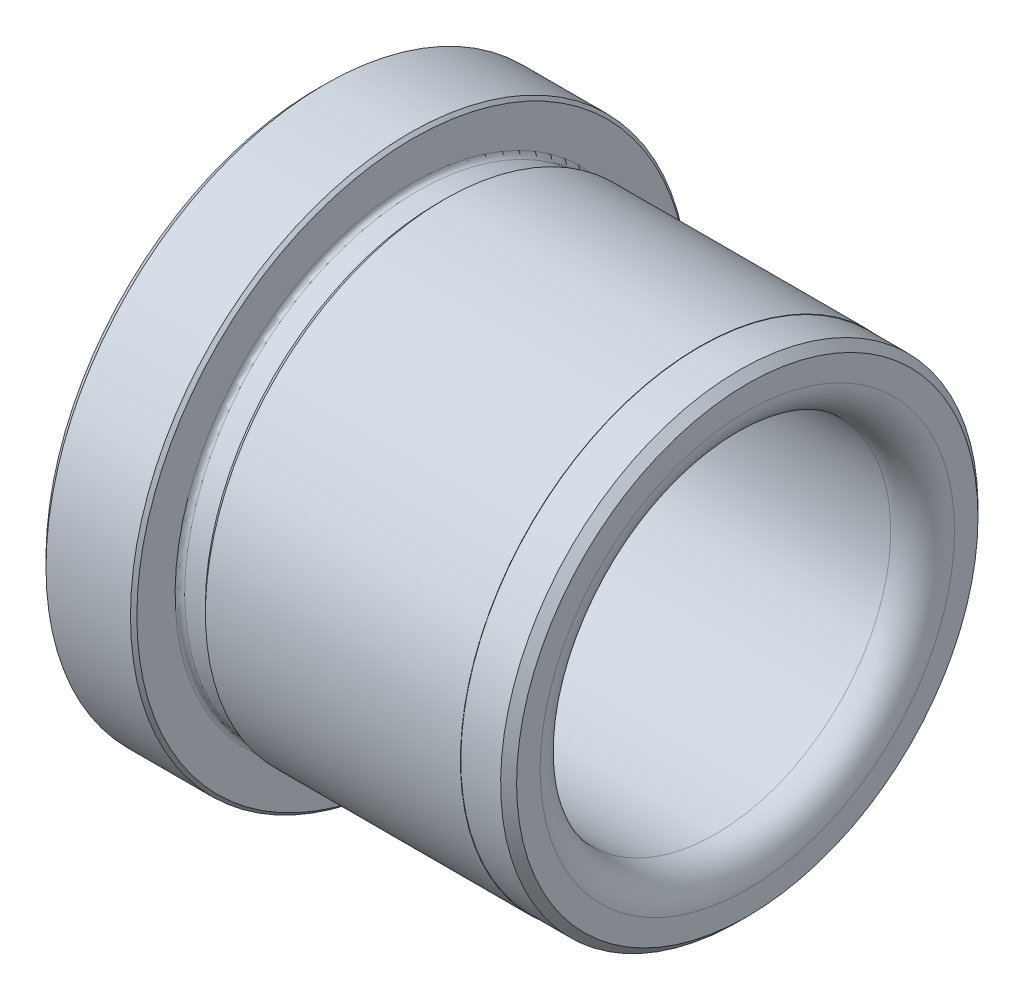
ISO-10303-21;
HEADER;
FILE_DESCRIPTION(('STEP AP214'),'2;1');
FILE_NAME('part.step','',(''),(''),'','','');
FILE_SCHEMA(('AUTOMOTIVE_DESIGN { 1 0 10303 214 1 1 1 1 }'));
ENDSEC;
DATA;
#1=APPLICATION_CONTEXT('core data for automotive mechanical design processes');
#2=APPLICATION_PROTOCOL_DEFINITION('international standard','automotive_design',2000,#1);
#3=PRODUCT_CONTEXT('',#1,'mechanical');
#4=PRODUCT('Part','Part','',(#3));
#5=PRODUCT_RELATED_PRODUCT_CATEGORY('part','',(#4));
#6=PRODUCT_DEFINITION_FORMATION('','',#4);
#7=PRODUCT_DEFINITION_CONTEXT('part definition',#1,'design');
#8=PRODUCT_DEFINITION('design','',#6,#7);
#9=PRODUCT_DEFINITION_SHAPE('','',#8);
#10=(LENGTH_UNIT() NAMED_UNIT(*) SI_UNIT(.MILLI.,.METRE.));
#11=(NAMED_UNIT(*) PLANE_ANGLE_UNIT() SI_UNIT($,.RADIAN.));
#12=(NAMED_UNIT(*) SI_UNIT($,.STERADIAN.) SOLID_ANGLE_UNIT());
#13=UNCERTAINTY_MEASURE_WITH_UNIT(LENGTH_MEASURE(1.E-05),#10,'distance_accuracy_value','');
#14=(GEOMETRIC_REPRESENTATION_CONTEXT(3) GLOBAL_UNCERTAINTY_ASSIGNED_CONTEXT((#13)) GLOBAL_UNIT_ASSIGNED_CONTEXT((#10,
#11,#12)) REPRESENTATION_CONTEXT('',''));
#15=CARTESIAN_POINT('',(0.,0.,0.));
#16=DIRECTION('',(0.,0.,1.));
#17=DIRECTION('',(1.,0.,0.));
#18=AXIS2_PLACEMENT_3D('',#15,#16,#17);
#19=CARTESIAN_POINT('',(-7.2,0.,0.));
#20=DIRECTION('',(1.,0.,0.));
#21=DIRECTION('',(0.,1.,0.));
#22=AXIS2_PLACEMENT_3D('',#19,#20,#21);
#23=TOROIDAL_SURFACE('',#22,14.9,0.300000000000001);
#24=CARTESIAN_POINT('',(-7.5,0.,0.));
#25=DIRECTION('',(1.,0.,0.));
#26=DIRECTION('',(0.,1.,0.));
#27=AXIS2_PLACEMENT_3D('',#24,#25,#26);
#28=CIRCLE('',#27,14.9);
#29=CARTESIAN_POINT('',(-7.50000000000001,14.9,0.));
#30=VERTEX_POINT('',#29);
#31=EDGE_CURVE('E83',#30,#30,#28,.T.);
#32=ORIENTED_EDGE('',*,*,#31,.T.);
#33=EDGE_LOOP('',(#32));
#34=FACE_BOUND('',#33,.T.);
#35=CARTESIAN_POINT('',(-7.2,0.,0.));
#36=DIRECTION('',(1.,0.,0.));
#37=DIRECTION('',(0.,1.,0.));
#38=AXIS2_PLACEMENT_3D('',#35,#36,#37);
#39=CIRCLE('',#38,14.6);
#40=CARTESIAN_POINT('',(-7.20000000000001,14.6,0.));
#41=VERTEX_POINT('',#40);
#42=EDGE_CURVE('E68',#41,#41,#39,.T.);
#43=ORIENTED_EDGE('',*,*,#42,.F.);
#44=EDGE_LOOP('',(#43));
#45=FACE_BOUND('',#44,.T.);
#46=ADVANCED_FACE('F30',(#34,#45),#23,.F.);
#47=CARTESIAN_POINT('',(13.5,0.,0.));
#48=DIRECTION('',(1.,0.,0.));
#49=DIRECTION('',(0.,1.,0.));
#50=AXIS2_PLACEMENT_3D('',#47,#48,#49);
#51=CYLINDRICAL_SURFACE('',#50,14.6);
#52=ORIENTED_EDGE('',*,*,#42,.T.);
#53=EDGE_LOOP('',(#52));
#54=FACE_BOUND('',#53,.T.);
#55=CARTESIAN_POINT('',(-5.9,0.,0.));
#56=DIRECTION('',(1.,0.,0.));
#57=DIRECTION('',(0.,1.,0.));
#58=AXIS2_PLACEMENT_3D('',#55,#56,#57);
#59=CIRCLE('',#58,14.6);
#60=CARTESIAN_POINT('',(-5.9,14.6,0.));
#61=VERTEX_POINT('',#60);
#62=EDGE_CURVE('E71',#61,#61,#59,.T.);
#63=ORIENTED_EDGE('',*,*,#62,.F.);
#64=EDGE_LOOP('',(#63));
#65=FACE_BOUND('',#64,.T.);
#66=ADVANCED_FACE('F104',(#54,#65),#51,.T.);
#67=CARTESIAN_POINT('',(-5.5,0.,0.));
#68=DIRECTION('',(1.,0.,0.));
#69=DIRECTION('',(0.,1.,0.));
#70=AXIS2_PLACEMENT_3D('',#67,#68,#69);
#71=CONICAL_SURFACE('',#70,15.,0.78539816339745);
#72=ORIENTED_EDGE('',*,*,#62,.T.);
#73=EDGE_LOOP('',(#72));
#74=FACE_BOUND('',#73,.T.);
#75=CARTESIAN_POINT('',(-5.5,0.,0.));
#76=DIRECTION('',(1.,0.,0.));
#77=DIRECTION('',(0.,1.,0.));
#78=AXIS2_PLACEMENT_3D('',#75,#76,#77);
#79=CIRCLE('',#78,15.);
#80=CARTESIAN_POINT('',(-5.50000000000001,15.,0.));
#81=VERTEX_POINT('',#80);
#82=EDGE_CURVE('E74',#81,#81,#79,.T.);
#83=ORIENTED_EDGE('',*,*,#82,.F.);
#84=EDGE_LOOP('',(#83));
#85=FACE_BOUND('',#84,.T.);
#86=ADVANCED_FACE('F109',(#74,#85),#71,.T.);
#87=CARTESIAN_POINT('',(13.5,0.,0.));
#88=DIRECTION('',(1.,0.,0.));
#89=DIRECTION('',(0.,1.,0.));
#90=AXIS2_PLACEMENT_3D('',#87,#88,#89);
#91=CYLINDRICAL_SURFACE('',#90,15.);
#92=ORIENTED_EDGE('',*,*,#82,.T.);
#93=EDGE_LOOP('',(#92));
#94=FACE_BOUND('',#93,.T.);
#95=CARTESIAN_POINT('',(10.5,0.,0.));
#96=DIRECTION('',(1.,0.,0.));
#97=DIRECTION('',(0.,1.,0.));
#98=AXIS2_PLACEMENT_3D('',#95,#96,#97);
#99=CIRCLE('',#98,15.);
#100=CARTESIAN_POINT('',(10.5,15.,0.));
#101=VERTEX_POINT('',#100);
#102=EDGE_CURVE('E77',#101,#101,#99,.T.);
#103=ORIENTED_EDGE('',*,*,#102,.F.);
#104=EDGE_LOOP('',(#103));
#105=FACE_BOUND('',#104,.T.);
#106=ADVANCED_FACE('F156',(#94,#105),#91,.T.);
#107=CARTESIAN_POINT('',(10.5,14.975,0.));
#108=DIRECTION('',(1.,0.,0.));
#109=DIRECTION('',(0.,1.,0.));
#110=AXIS2_PLACEMENT_3D('',#107,#108,#109);
#111=PLANE('',#110);
#112=ORIENTED_EDGE('',*,*,#102,.T.);
#113=EDGE_LOOP('',(#112));
#114=FACE_BOUND('',#113,.T.);
#115=CARTESIAN_POINT('',(10.5,0.,0.));
#116=DIRECTION('',(1.,0.,0.));
#117=DIRECTION('',(0.,1.,0.));
#118=AXIS2_PLACEMENT_3D('',#115,#116,#117);
#119=CIRCLE('',#118,14.975);
#120=CARTESIAN_POINT('',(10.5,14.975,0.));
#121=VERTEX_POINT('',#120);
#122=EDGE_CURVE('E80',#121,#121,#119,.T.);
#123=ORIENTED_EDGE('',*,*,#122,.F.);
#124=EDGE_LOOP('',(#123));
#125=FACE_BOUND('',#124,.T.);
#126=ADVANCED_FACE('F150',(#114,#125),#111,.T.);
#127=CARTESIAN_POINT('',(13.5,0.,0.));
#128=DIRECTION('',(1.,0.,0.));
#129=DIRECTION('',(0.,1.,0.));
#130=AXIS2_PLACEMENT_3D('',#127,#128,#129);
#131=CYLINDRICAL_SURFACE('',#130,14.975);
#132=CARTESIAN_POINT('',(13.,0.,0.));
#133=DIRECTION('',(1.,0.,0.));
#134=DIRECTION('',(0.,1.,0.));
#135=AXIS2_PLACEMENT_3D('',#132,#133,#134);
#136=CIRCLE('',#135,14.975);
#137=CARTESIAN_POINT('',(13.,14.975,0.));
#138=VERTEX_POINT('',#137);
#139=EDGE_CURVE('E41',#138,#138,#136,.F.);
#140=ORIENTED_EDGE('',*,*,#139,.T.);
#141=EDGE_LOOP('',(#140));
#142=FACE_BOUND('',#141,.T.);
#143=ORIENTED_EDGE('',*,*,#122,.T.);
#144=EDGE_LOOP('',(#143));
#145=FACE_BOUND('',#144,.T.);
#146=ADVANCED_FACE('F138',(#142,#145),#131,.T.);
#147=CARTESIAN_POINT('',(13.5,14.975,0.));
#148=DIRECTION('',(1.,0.,0.));
#149=DIRECTION('',(0.,1.,0.));
#150=AXIS2_PLACEMENT_3D('',#147,#148,#149);
#151=PLANE('',#150);
#152=CARTESIAN_POINT('',(13.5,0.,0.));
#153=DIRECTION('',(1.,0.,0.));
#154=DIRECTION('',(0.,1.,0.));
#155=AXIS2_PLACEMENT_3D('',#152,#153,#154);
#156=CIRCLE('',#155,14.475);
#157=CARTESIAN_POINT('',(13.5,14.475,0.));
#158=VERTEX_POINT('',#157);
#159=EDGE_CURVE('E45',#158,#158,#156,.T.);
#160=ORIENTED_EDGE('',*,*,#159,.T.);
#161=EDGE_LOOP('',(#160));
#162=FACE_BOUND('',#161,.T.);
#163=CARTESIAN_POINT('',(13.5,0.,0.));
#164=DIRECTION('',(1.,0.,0.));
#165=DIRECTION('',(0.,1.,0.));
#166=AXIS2_PLACEMENT_3D('',#163,#164,#165);
#167=CIRCLE('',#166,13.);
#168=CARTESIAN_POINT('',(13.5,13.,0.));
#169=VERTEX_POINT('',#168);
#170=EDGE_CURVE('E62',#169,#169,#167,.F.);
#171=ORIENTED_EDGE('',*,*,#170,.T.);
#172=EDGE_LOOP('',(#171));
#173=FACE_BOUND('',#172,.T.);
#174=ADVANCED_FACE('F135',(#162,#173),#151,.T.);
#175=CARTESIAN_POINT('',(-13.5,17.5,0.));
#176=DIRECTION('',(-1.,0.,0.));
#177=DIRECTION('',(0.,-1.,0.));
#178=AXIS2_PLACEMENT_3D('',#175,#176,#177);
#179=PLANE('',#178);
#180=CARTESIAN_POINT('',(-13.5,0.,0.));
#181=DIRECTION('',(-1.,0.,0.));
#182=DIRECTION('',(0.,-1.,0.));
#183=AXIS2_PLACEMENT_3D('',#180,#181,#182);
#184=CIRCLE('',#183,11.5);
#185=CARTESIAN_POINT('',(-13.5,-11.5,0.));
#186=VERTEX_POINT('',#185);
#187=EDGE_CURVE('E53',#186,#186,#184,.F.);
#188=ORIENTED_EDGE('',*,*,#187,.T.);
#189=EDGE_LOOP('',(#188));
#190=FACE_BOUND('',#189,.T.);
#191=CARTESIAN_POINT('',(-13.5,0.,0.));
#192=DIRECTION('',(-1.,0.,0.));
#193=DIRECTION('',(0.,-1.,0.));
#194=AXIS2_PLACEMENT_3D('',#191,#192,#193);
#195=CIRCLE('',#194,17.);
#196=CARTESIAN_POINT('',(-13.5,-17.,0.));
#197=VERTEX_POINT('',#196);
#198=EDGE_CURVE('E56',#197,#197,#195,.T.);
#199=ORIENTED_EDGE('',*,*,#198,.T.);
#200=EDGE_LOOP('',(#199));
#201=FACE_BOUND('',#200,.T.);
#202=ADVANCED_FACE('F101',(#190,#201),#179,.T.);
#203=CARTESIAN_POINT('',(13.5,0.,0.));
#204=DIRECTION('',(1.,0.,0.));
#205=DIRECTION('',(0.,1.,0.));
#206=AXIS2_PLACEMENT_3D('',#203,#204,#205);
#207=CYLINDRICAL_SURFACE('',#206,17.5);
#208=CARTESIAN_POINT('',(-7.7,0.,0.));
#209=DIRECTION('',(1.,0.,0.));
#210=DIRECTION('',(0.,1.,0.));
#211=AXIS2_PLACEMENT_3D('',#208,#209,#210);
#212=CIRCLE('',#211,17.5);
#213=CARTESIAN_POINT('',(-7.7,17.5,0.));
#214=VERTEX_POINT('',#213);
#215=EDGE_CURVE('E11',#214,#214,#212,.F.);
#216=ORIENTED_EDGE('',*,*,#215,.T.);
#217=EDGE_LOOP('',(#216));
#218=FACE_BOUND('',#217,.T.);
#219=CARTESIAN_POINT('',(-13.,0.,0.));
#220=DIRECTION('',(-1.,0.,0.));
#221=DIRECTION('',(0.,-1.,0.));
#222=AXIS2_PLACEMENT_3D('',#219,#220,#221);
#223=CIRCLE('',#222,17.5);
#224=CARTESIAN_POINT('',(-13.,-17.5,0.));
#225=VERTEX_POINT('',#224);
#226=EDGE_CURVE('E50',#225,#225,#223,.F.);
#227=ORIENTED_EDGE('',*,*,#226,.T.);
#228=EDGE_LOOP('',(#227));
#229=FACE_BOUND('',#228,.T.);
#230=ADVANCED_FACE('F92',(#218,#229),#207,.T.);
#231=CARTESIAN_POINT('',(-7.50000000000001,17.5,0.));
#232=DIRECTION('',(1.,0.,0.));
#233=DIRECTION('',(0.,1.,0.));
#234=AXIS2_PLACEMENT_3D('',#231,#232,#233);
#235=PLANE('',#234);
#236=CARTESIAN_POINT('',(-7.5,0.,0.));
#237=DIRECTION('',(1.,0.,0.));
#238=DIRECTION('',(0.,1.,0.));
#239=AXIS2_PLACEMENT_3D('',#236,#237,#238);
#240=CIRCLE('',#239,17.3);
#241=CARTESIAN_POINT('',(-7.50000000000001,17.3,0.));
#242=VERTEX_POINT('',#241);
#243=EDGE_CURVE('E37',#242,#242,#240,.T.);
#244=ORIENTED_EDGE('',*,*,#243,.T.);
#245=EDGE_LOOP('',(#244));
#246=FACE_BOUND('',#245,.T.);
#247=ORIENTED_EDGE('',*,*,#31,.F.);
#248=EDGE_LOOP('',(#247));
#249=FACE_BOUND('',#248,.T.);
#250=ADVANCED_FACE('F89',(#246,#249),#235,.T.);
#251=CARTESIAN_POINT('',(-62.5,0.,0.));
#252=DIRECTION('',(1.,0.,0.));
#253=DIRECTION('',(0.,1.,0.));
#254=AXIS2_PLACEMENT_3D('',#251,#252,#253);
#255=CYLINDRICAL_SURFACE('',#254,11.);
#256=CARTESIAN_POINT('',(-13.,0.,0.));
#257=DIRECTION('',(-1.,0.,0.));
#258=DIRECTION('',(0.,-1.,0.));
#259=AXIS2_PLACEMENT_3D('',#256,#257,#258);
#260=CIRCLE('',#259,11.);
#261=CARTESIAN_POINT('',(-13.,-11.,0.));
#262=VERTEX_POINT('',#261);
#263=EDGE_CURVE('E59',#262,#262,#260,.T.);
#264=ORIENTED_EDGE('',*,*,#263,.T.);
#265=EDGE_LOOP('',(#264));
#266=FACE_BOUND('',#265,.T.);
#267=CARTESIAN_POINT('',(11.5,0.,0.));
#268=DIRECTION('',(1.,0.,0.));
#269=DIRECTION('',(0.,1.,0.));
#270=AXIS2_PLACEMENT_3D('',#267,#268,#269);
#271=CIRCLE('',#270,11.);
#272=CARTESIAN_POINT('',(11.5,11.,0.));
#273=VERTEX_POINT('',#272);
#274=EDGE_CURVE('E65',#273,#273,#271,.T.);
#275=ORIENTED_EDGE('',*,*,#274,.T.);
#276=EDGE_LOOP('',(#275));
#277=FACE_BOUND('',#276,.T.);
#278=ADVANCED_FACE('F91',(#266,#277),#255,.F.);
#279=CARTESIAN_POINT('',(11.5,0.,0.));
#280=DIRECTION('',(1.,0.,0.));
#281=DIRECTION('',(0.,1.,0.));
#282=AXIS2_PLACEMENT_3D('',#279,#280,#281);
#283=TOROIDAL_SURFACE('',#282,13.,2.);
#284=ORIENTED_EDGE('',*,*,#170,.F.);
#285=EDGE_LOOP('',(#284));
#286=FACE_BOUND('',#285,.T.);
#287=ORIENTED_EDGE('',*,*,#274,.F.);
#288=EDGE_LOOP('',(#287));
#289=FACE_BOUND('',#288,.T.);
#290=ADVANCED_FACE('F98',(#286,#289),#283,.T.);
#291=CARTESIAN_POINT('',(-13.,0.,0.));
#292=DIRECTION('',(-1.,0.,0.));
#293=DIRECTION('',(0.,-1.,0.));
#294=AXIS2_PLACEMENT_3D('',#291,#292,#293);
#295=CONICAL_SURFACE('',#294,11.,0.785398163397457);
#296=ORIENTED_EDGE('',*,*,#187,.F.);
#297=EDGE_LOOP('',(#296));
#298=FACE_BOUND('',#297,.T.);
#299=ORIENTED_EDGE('',*,*,#263,.F.);
#300=EDGE_LOOP('',(#299));
#301=FACE_BOUND('',#300,.T.);
#302=ADVANCED_FACE('F116',(#298,#301),#295,.F.);
#303=CARTESIAN_POINT('',(-13.,0.,0.));
#304=DIRECTION('',(1.,0.,0.));
#305=DIRECTION('',(0.,1.,0.));
#306=AXIS2_PLACEMENT_3D('',#303,#304,#305);
#307=CONICAL_SURFACE('',#306,17.5,0.785398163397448);
#308=ORIENTED_EDGE('',*,*,#198,.F.);
#309=EDGE_LOOP('',(#308));
#310=FACE_BOUND('',#309,.T.);
#311=ORIENTED_EDGE('',*,*,#226,.F.);
#312=EDGE_LOOP('',(#311));
#313=FACE_BOUND('',#312,.T.);
#314=ADVANCED_FACE('F120',(#310,#313),#307,.T.);
#315=CARTESIAN_POINT('',(13.5,0.,0.));
#316=DIRECTION('',(-1.,0.,0.));
#317=DIRECTION('',(0.,-1.,0.));
#318=AXIS2_PLACEMENT_3D('',#315,#316,#317);
#319=CONICAL_SURFACE('',#318,14.475,0.785398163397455);
#320=ORIENTED_EDGE('',*,*,#139,.F.);
#321=EDGE_LOOP('',(#320));
#322=FACE_BOUND('',#321,.T.);
#323=ORIENTED_EDGE('',*,*,#159,.F.);
#324=EDGE_LOOP('',(#323));
#325=FACE_BOUND('',#324,.T.);
#326=ADVANCED_FACE('F123',(#322,#325),#319,.T.);
#327=CARTESIAN_POINT('',(-7.5,0.,0.));
#328=DIRECTION('',(-1.,0.,0.));
#329=DIRECTION('',(0.,-1.,0.));
#330=AXIS2_PLACEMENT_3D('',#327,#328,#329);
#331=CONICAL_SURFACE('',#330,17.3,0.785398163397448);
#332=ORIENTED_EDGE('',*,*,#215,.F.);
#333=EDGE_LOOP('',(#332));
#334=FACE_BOUND('',#333,.T.);
#335=ORIENTED_EDGE('',*,*,#243,.F.);
#336=EDGE_LOOP('',(#335));
#337=FACE_BOUND('',#336,.T.);
#338=ADVANCED_FACE('F32',(#334,#337),#331,.T.);
#339=CLOSED_SHELL('',(#46,#66,#86,#106,#126,#146,#174,#202,#230,#250,#278,#290,#302,#314,#326,#338));
#340=MANIFOLD_SOLID_BREP('B2',#339);
#341=ADVANCED_BREP_SHAPE_REPRESENTATION('',(#18,#340),#14);
#342=SHAPE_DEFINITION_REPRESENTATION(#9,#341);
ENDSEC;
END-ISO-10303-21;
